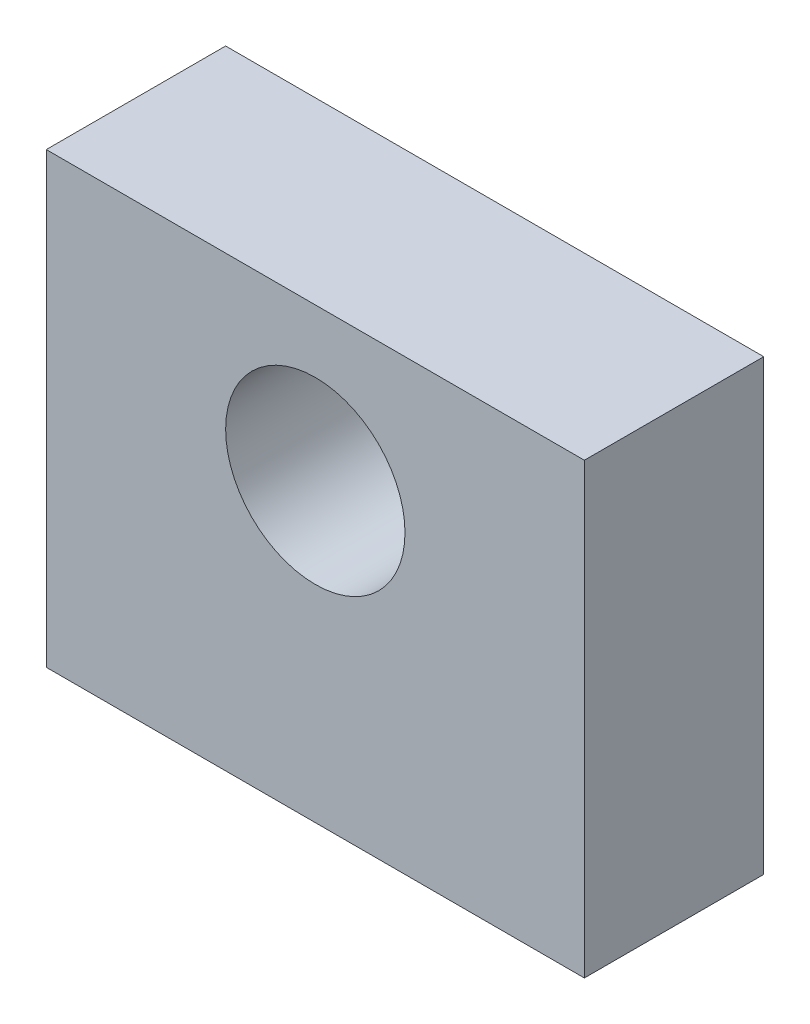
ISO-10303-21;
HEADER;
FILE_DESCRIPTION(('STEP AP214'),'2;1');
FILE_NAME('part.step','',(''),(''),'','','');
FILE_SCHEMA(('AUTOMOTIVE_DESIGN { 1 0 10303 214 1 1 1 1 }'));
ENDSEC;
DATA;
#1=APPLICATION_CONTEXT('core data for automotive mechanical design processes');
#2=APPLICATION_PROTOCOL_DEFINITION('international standard','automotive_design',2000,#1);
#3=PRODUCT_CONTEXT('',#1,'mechanical');
#4=PRODUCT('Part','Part','',(#3));
#5=PRODUCT_RELATED_PRODUCT_CATEGORY('part','',(#4));
#6=PRODUCT_DEFINITION_FORMATION('','',#4);
#7=PRODUCT_DEFINITION_CONTEXT('part definition',#1,'design');
#8=PRODUCT_DEFINITION('design','',#6,#7);
#9=PRODUCT_DEFINITION_SHAPE('','',#8);
#10=(LENGTH_UNIT() NAMED_UNIT(*) SI_UNIT(.MILLI.,.METRE.));
#11=(NAMED_UNIT(*) PLANE_ANGLE_UNIT() SI_UNIT($,.RADIAN.));
#12=(NAMED_UNIT(*) SI_UNIT($,.STERADIAN.) SOLID_ANGLE_UNIT());
#13=UNCERTAINTY_MEASURE_WITH_UNIT(LENGTH_MEASURE(1.E-05),#10,'distance_accuracy_value','');
#14=(GEOMETRIC_REPRESENTATION_CONTEXT(3) GLOBAL_UNCERTAINTY_ASSIGNED_CONTEXT((#13)) GLOBAL_UNIT_ASSIGNED_CONTEXT((#10,
#11,#12)) REPRESENTATION_CONTEXT('',''));
#15=CARTESIAN_POINT('',(0.,0.,0.));
#16=DIRECTION('',(0.,0.,1.));
#17=DIRECTION('',(1.,0.,0.));
#18=AXIS2_PLACEMENT_3D('',#15,#16,#17);
#19=CARTESIAN_POINT('',(-30.,50.0000000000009,0.));
#20=DIRECTION('',(1.,0.,0.));
#21=DIRECTION('',(0.,0.,-0.999999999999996));
#22=AXIS2_PLACEMENT_3D('',#19,#20,#21);
#23=PLANE('',#22);
#24=DIRECTION('',(0.,0.,0.999999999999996));
#25=VECTOR('',#24,1.);
#26=CARTESIAN_POINT('',(-30.,0.,0.));
#27=LINE('',#26,#25);
#28=CARTESIAN_POINT('',(-30.,0.,-19.9999999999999));
#29=VERTEX_POINT('',#28);
#30=CARTESIAN_POINT('',(-30.,0.,0.));
#31=VERTEX_POINT('',#30);
#32=EDGE_CURVE('E119',#29,#31,#27,.T.);
#33=ORIENTED_EDGE('',*,*,#32,.T.);
#34=DIRECTION('',(0.,-1.00000000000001,0.));
#35=VECTOR('',#34,1.);
#36=CARTESIAN_POINT('',(-30.,50.0000000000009,0.));
#37=LINE('',#36,#35);
#38=CARTESIAN_POINT('',(-30.,50.0000000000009,0.));
#39=VERTEX_POINT('',#38);
#40=EDGE_CURVE('E11',#39,#31,#37,.T.);
#41=ORIENTED_EDGE('',*,*,#40,.F.);
#42=DIRECTION('',(0.,0.,0.999999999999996));
#43=VECTOR('',#42,1.);
#44=CARTESIAN_POINT('',(-30.,50.0000000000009,0.));
#45=LINE('',#44,#43);
#46=CARTESIAN_POINT('',(-30.0000000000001,50.0000000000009,-19.9999999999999));
#47=VERTEX_POINT('',#46);
#48=EDGE_CURVE('E132',#47,#39,#45,.T.);
#49=ORIENTED_EDGE('',*,*,#48,.F.);
#50=DIRECTION('',(0.,-1.00000000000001,0.));
#51=VECTOR('',#50,1.);
#52=CARTESIAN_POINT('',(-30.0000000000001,50.0000000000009,-19.9999999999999));
#53=LINE('',#52,#51);
#54=EDGE_CURVE('E141',#47,#29,#53,.T.);
#55=ORIENTED_EDGE('',*,*,#54,.T.);
#56=EDGE_LOOP('',(#33,#41,#49,#55));
#57=FACE_BOUND('',#56,.T.);
#58=ADVANCED_FACE('F42',(#57),#23,.F.);
#59=CARTESIAN_POINT('',(-30.,50.0000000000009,0.));
#60=DIRECTION('',(0.,0.,-0.999999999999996));
#61=DIRECTION('',(-1.,0.,0.));
#62=AXIS2_PLACEMENT_3D('',#59,#60,#61);
#63=PLANE('',#62);
#64=CARTESIAN_POINT('',(-1.17961196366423E-13,33.0000000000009,0.));
#65=DIRECTION('',(0.,0.,-0.999999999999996));
#66=DIRECTION('',(-1.,0.,0.));
#67=AXIS2_PLACEMENT_3D('',#64,#65,#66);
#68=CIRCLE('',#67,10.);
#69=CARTESIAN_POINT('',(-10.0000000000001,33.0000000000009,0.));
#70=VERTEX_POINT('',#69);
#71=EDGE_CURVE('E99',#70,#70,#68,.F.);
#72=ORIENTED_EDGE('',*,*,#71,.F.);
#73=EDGE_LOOP('',(#72));
#74=FACE_BOUND('',#73,.T.);
#75=DIRECTION('',(1.,0.,0.));
#76=VECTOR('',#75,1.);
#77=CARTESIAN_POINT('',(-30.,0.,0.));
#78=LINE('',#77,#76);
#79=CARTESIAN_POINT('',(30.,0.,3.77475828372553E-12));
#80=VERTEX_POINT('',#79);
#81=EDGE_CURVE('E123',#31,#80,#78,.T.);
#82=ORIENTED_EDGE('',*,*,#81,.T.);
#83=DIRECTION('',(0.,-1.00000000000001,0.));
#84=VECTOR('',#83,1.);
#85=CARTESIAN_POINT('',(30.0000000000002,50.0000000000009,3.77475828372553E-12));
#86=LINE('',#85,#84);
#87=CARTESIAN_POINT('',(30.0000000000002,50.0000000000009,3.77475828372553E-12));
#88=VERTEX_POINT('',#87);
#89=EDGE_CURVE('E50',#88,#80,#86,.T.);
#90=ORIENTED_EDGE('',*,*,#89,.F.);
#91=DIRECTION('',(1.,0.,0.));
#92=VECTOR('',#91,1.);
#93=CARTESIAN_POINT('',(-30.,50.0000000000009,0.));
#94=LINE('',#93,#92);
#95=EDGE_CURVE('E135',#39,#88,#94,.T.);
#96=ORIENTED_EDGE('',*,*,#95,.F.);
#97=ORIENTED_EDGE('',*,*,#40,.T.);
#98=EDGE_LOOP('',(#82,#90,#96,#97));
#99=FACE_BOUND('',#98,.T.);
#100=ADVANCED_FACE('F165',(#74,#99),#63,.F.);
#101=CARTESIAN_POINT('',(30.0000000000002,50.0000000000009,3.77475828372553E-12));
#102=DIRECTION('',(-1.,0.,0.));
#103=DIRECTION('',(0.,0.,0.999999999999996));
#104=AXIS2_PLACEMENT_3D('',#101,#102,#103);
#105=PLANE('',#104);
#106=DIRECTION('',(0.,0.,-0.999999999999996));
#107=VECTOR('',#106,1.);
#108=CARTESIAN_POINT('',(30.,0.,3.77475828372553E-12));
#109=LINE('',#108,#107);
#110=CARTESIAN_POINT('',(30.,0.,-19.9999999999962));
#111=VERTEX_POINT('',#110);
#112=EDGE_CURVE('E126',#80,#111,#109,.T.);
#113=ORIENTED_EDGE('',*,*,#112,.T.);
#114=DIRECTION('',(0.,-1.00000000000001,0.));
#115=VECTOR('',#114,1.);
#116=CARTESIAN_POINT('',(30.,50.0000000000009,-19.9999999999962));
#117=LINE('',#116,#115);
#118=CARTESIAN_POINT('',(30.,50.0000000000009,-19.9999999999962));
#119=VERTEX_POINT('',#118);
#120=EDGE_CURVE('E145',#119,#111,#117,.T.);
#121=ORIENTED_EDGE('',*,*,#120,.F.);
#122=DIRECTION('',(0.,0.,-0.999999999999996));
#123=VECTOR('',#122,1.);
#124=CARTESIAN_POINT('',(30.0000000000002,50.0000000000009,3.77475828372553E-12));
#125=LINE('',#124,#123);
#126=EDGE_CURVE('E62',#88,#119,#125,.T.);
#127=ORIENTED_EDGE('',*,*,#126,.F.);
#128=ORIENTED_EDGE('',*,*,#89,.T.);
#129=EDGE_LOOP('',(#113,#121,#127,#128));
#130=FACE_BOUND('',#129,.T.);
#131=ADVANCED_FACE('F153',(#130),#105,.F.);
#132=CARTESIAN_POINT('',(-30.0000000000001,50.0000000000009,-19.9999999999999));
#133=DIRECTION('',(0.,0.,0.999999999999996));
#134=DIRECTION('',(1.,0.,0.));
#135=AXIS2_PLACEMENT_3D('',#132,#133,#134);
#136=PLANE('',#135);
#137=CARTESIAN_POINT('',(-1.17961196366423E-13,33.0000000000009,-20.));
#138=DIRECTION('',(0.,0.,-0.999999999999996));
#139=DIRECTION('',(-1.,0.,0.));
#140=AXIS2_PLACEMENT_3D('',#137,#138,#139);
#141=CIRCLE('',#140,10.);
#142=CARTESIAN_POINT('',(-10.0000000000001,33.0000000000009,-20.));
#143=VERTEX_POINT('',#142);
#144=EDGE_CURVE('E108',#143,#143,#141,.T.);
#145=ORIENTED_EDGE('',*,*,#144,.F.);
#146=EDGE_LOOP('',(#145));
#147=FACE_BOUND('',#146,.T.);
#148=DIRECTION('',(-1.,0.,0.));
#149=VECTOR('',#148,1.);
#150=CARTESIAN_POINT('',(-30.,0.,-19.9999999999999));
#151=LINE('',#150,#149);
#152=EDGE_CURVE('E129',#111,#29,#151,.T.);
#153=ORIENTED_EDGE('',*,*,#152,.T.);
#154=ORIENTED_EDGE('',*,*,#54,.F.);
#155=DIRECTION('',(-1.,0.,0.));
#156=VECTOR('',#155,1.);
#157=CARTESIAN_POINT('',(-30.0000000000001,50.0000000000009,-19.9999999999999));
#158=LINE('',#157,#156);
#159=EDGE_CURVE('E57',#119,#47,#158,.T.);
#160=ORIENTED_EDGE('',*,*,#159,.F.);
#161=ORIENTED_EDGE('',*,*,#120,.T.);
#162=EDGE_LOOP('',(#153,#154,#160,#161));
#163=FACE_BOUND('',#162,.T.);
#164=ADVANCED_FACE('F160',(#147,#163),#136,.F.);
#165=CARTESIAN_POINT('',(-30.0000000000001,50.0000000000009,-19.9999999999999));
#166=DIRECTION('',(0.,-1.00000000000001,0.));
#167=DIRECTION('',(0.,0.,-0.999999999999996));
#168=AXIS2_PLACEMENT_3D('',#165,#166,#167);
#169=PLANE('',#168);
#170=ORIENTED_EDGE('',*,*,#48,.T.);
#171=ORIENTED_EDGE('',*,*,#95,.T.);
#172=ORIENTED_EDGE('',*,*,#126,.T.);
#173=ORIENTED_EDGE('',*,*,#159,.T.);
#174=EDGE_LOOP('',(#170,#171,#172,#173));
#175=FACE_BOUND('',#174,.T.);
#176=ADVANCED_FACE('F164',(#175),#169,.F.);
#177=CARTESIAN_POINT('',(-30.,0.,-19.9999999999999));
#178=DIRECTION('',(0.,-1.00000000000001,0.));
#179=DIRECTION('',(0.,0.,-0.999999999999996));
#180=AXIS2_PLACEMENT_3D('',#177,#178,#179);
#181=PLANE('',#180);
#182=CARTESIAN_POINT('',(-18.,0.,-9.99999999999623));
#183=DIRECTION('',(0.,-1.00000000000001,0.));
#184=DIRECTION('',(0.,0.,-0.999999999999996));
#185=AXIS2_PLACEMENT_3D('',#182,#183,#184);
#186=CIRCLE('',#185,3.39999999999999);
#187=CARTESIAN_POINT('',(-18.,0.,-13.3999999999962));
#188=VERTEX_POINT('',#187);
#189=EDGE_CURVE('E98',#188,#188,#186,.T.);
#190=ORIENTED_EDGE('',*,*,#189,.F.);
#191=EDGE_LOOP('',(#190));
#192=FACE_BOUND('',#191,.T.);
#193=CARTESIAN_POINT('',(18.,0.,-10.));
#194=DIRECTION('',(0.,-1.00000000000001,0.));
#195=DIRECTION('',(0.,0.,-0.999999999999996));
#196=AXIS2_PLACEMENT_3D('',#193,#194,#195);
#197=CIRCLE('',#196,3.39999999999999);
#198=CARTESIAN_POINT('',(18.,0.,-13.4));
#199=VERTEX_POINT('',#198);
#200=EDGE_CURVE('E115',#199,#199,#197,.T.);
#201=ORIENTED_EDGE('',*,*,#200,.F.);
#202=EDGE_LOOP('',(#201));
#203=FACE_BOUND('',#202,.T.);
#204=ORIENTED_EDGE('',*,*,#32,.F.);
#205=ORIENTED_EDGE('',*,*,#152,.F.);
#206=ORIENTED_EDGE('',*,*,#112,.F.);
#207=ORIENTED_EDGE('',*,*,#81,.F.);
#208=EDGE_LOOP('',(#204,#205,#206,#207));
#209=FACE_BOUND('',#208,.T.);
#210=ADVANCED_FACE('F158',(#192,#203,#209),#181,.T.);
#211=CARTESIAN_POINT('',(18.,0.,-10.));
#212=DIRECTION('',(0.,-1.00000000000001,0.));
#213=DIRECTION('',(0.,0.,-0.999999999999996));
#214=AXIS2_PLACEMENT_3D('',#211,#212,#213);
#215=CYLINDRICAL_SURFACE('',#214,3.39999999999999);
#216=CARTESIAN_POINT('',(18.,22.25,-10.));
#217=DIRECTION('',(0.,-1.00000000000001,0.));
#218=DIRECTION('',(0.,0.,-0.999999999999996));
#219=AXIS2_PLACEMENT_3D('',#216,#217,#218);
#220=CIRCLE('',#219,3.39999999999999);
#221=CARTESIAN_POINT('',(18.,22.25,-13.4));
#222=VERTEX_POINT('',#221);
#223=EDGE_CURVE('E104',#222,#222,#220,.T.);
#224=ORIENTED_EDGE('',*,*,#223,.F.);
#225=EDGE_LOOP('',(#224));
#226=FACE_BOUND('',#225,.T.);
#227=ORIENTED_EDGE('',*,*,#200,.T.);
#228=EDGE_LOOP('',(#227));
#229=FACE_BOUND('',#228,.T.);
#230=ADVANCED_FACE('F182',(#226,#229),#215,.F.);
#231=CARTESIAN_POINT('',(18.,22.25,-10.));
#232=DIRECTION('',(0.,-1.00000000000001,0.));
#233=DIRECTION('',(0.,0.,-0.999999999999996));
#234=AXIS2_PLACEMENT_3D('',#231,#232,#233);
#235=CONICAL_SURFACE('',#234,3.39999999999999,1.02974425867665);
#236=CARTESIAN_POINT('',(18.,24.2929261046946,-10.));
#237=VERTEX_POINT('',#236);
#238=VERTEX_LOOP('',#237);
#239=FACE_BOUND('',#238,.T.);
#240=ORIENTED_EDGE('',*,*,#223,.T.);
#241=EDGE_LOOP('',(#240));
#242=FACE_BOUND('',#241,.T.);
#243=ADVANCED_FACE('F186',(#239,#242),#235,.F.);
#244=CARTESIAN_POINT('',(-18.,0.,-9.99999999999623));
#245=DIRECTION('',(0.,-1.00000000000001,0.));
#246=DIRECTION('',(0.,0.,-0.999999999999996));
#247=AXIS2_PLACEMENT_3D('',#244,#245,#246);
#248=CYLINDRICAL_SURFACE('',#247,3.39999999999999);
#249=CARTESIAN_POINT('',(-18.,22.25,-9.99999999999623));
#250=DIRECTION('',(0.,-1.00000000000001,0.));
#251=DIRECTION('',(0.,0.,-0.999999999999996));
#252=AXIS2_PLACEMENT_3D('',#249,#250,#251);
#253=CIRCLE('',#252,3.39999999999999);
#254=CARTESIAN_POINT('',(-18.,22.25,-13.3999999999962));
#255=VERTEX_POINT('',#254);
#256=EDGE_CURVE('E95',#255,#255,#253,.T.);
#257=ORIENTED_EDGE('',*,*,#256,.F.);
#258=EDGE_LOOP('',(#257));
#259=FACE_BOUND('',#258,.T.);
#260=ORIENTED_EDGE('',*,*,#189,.T.);
#261=EDGE_LOOP('',(#260));
#262=FACE_BOUND('',#261,.T.);
#263=ADVANCED_FACE('F91',(#259,#262),#248,.F.);
#264=CARTESIAN_POINT('',(-18.,22.25,-9.99999999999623));
#265=DIRECTION('',(0.,-1.00000000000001,0.));
#266=DIRECTION('',(0.,0.,-0.999999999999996));
#267=AXIS2_PLACEMENT_3D('',#264,#265,#266);
#268=CONICAL_SURFACE('',#267,3.39999999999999,1.02974425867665);
#269=CARTESIAN_POINT('',(-18.,24.2929261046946,-9.99999999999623));
#270=VERTEX_POINT('',#269);
#271=VERTEX_LOOP('',#270);
#272=FACE_BOUND('',#271,.T.);
#273=ORIENTED_EDGE('',*,*,#256,.T.);
#274=EDGE_LOOP('',(#273));
#275=FACE_BOUND('',#274,.T.);
#276=ADVANCED_FACE('F87',(#272,#275),#268,.F.);
#277=CARTESIAN_POINT('',(-1.17961196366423E-13,33.0000000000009,0.00100000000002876));
#278=DIRECTION('',(0.,0.,-0.999999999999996));
#279=DIRECTION('',(-1.,0.,0.));
#280=AXIS2_PLACEMENT_3D('',#277,#278,#279);
#281=CYLINDRICAL_SURFACE('',#280,10.);
#282=CARTESIAN_POINT('',(-10.0000000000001,33.0000000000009,-20.));
#283=CARTESIAN_POINT('',(-10.0000000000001,33.0000000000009,-19.7916666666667));
#284=CARTESIAN_POINT('',(-10.0000000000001,33.0000000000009,-19.5833333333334));
#285=CARTESIAN_POINT('',(-10.0000000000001,33.0000000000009,-19.1666666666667));
#286=CARTESIAN_POINT('',(-10.0000000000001,33.0000000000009,-18.9583333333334));
#287=CARTESIAN_POINT('',(-10.0000000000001,33.0000000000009,-18.5416666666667));
#288=CARTESIAN_POINT('',(-10.0000000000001,33.0000000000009,-18.3333333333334));
#289=CARTESIAN_POINT('',(-10.0000000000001,33.0000000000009,-17.9166666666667));
#290=CARTESIAN_POINT('',(-10.0000000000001,33.0000000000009,-17.7083333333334));
#291=CARTESIAN_POINT('',(-10.0000000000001,33.0000000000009,-17.2916666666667));
#292=CARTESIAN_POINT('',(-10.0000000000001,33.0000000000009,-17.0833333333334));
#293=CARTESIAN_POINT('',(-10.0000000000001,33.0000000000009,-16.6666666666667));
#294=CARTESIAN_POINT('',(-10.0000000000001,33.0000000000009,-16.4583333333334));
#295=CARTESIAN_POINT('',(-10.0000000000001,33.0000000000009,-16.0416666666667));
#296=CARTESIAN_POINT('',(-10.0000000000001,33.0000000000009,-15.8333333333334));
#297=CARTESIAN_POINT('',(-10.0000000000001,33.0000000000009,-15.4166666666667));
#298=CARTESIAN_POINT('',(-10.0000000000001,33.0000000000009,-15.2083333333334));
#299=CARTESIAN_POINT('',(-10.0000000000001,33.0000000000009,-14.7916666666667));
#300=CARTESIAN_POINT('',(-10.0000000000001,33.0000000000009,-14.5833333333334));
#301=CARTESIAN_POINT('',(-10.0000000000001,33.0000000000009,-14.1666666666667));
#302=CARTESIAN_POINT('',(-10.0000000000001,33.0000000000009,-13.9583333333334));
#303=CARTESIAN_POINT('',(-10.0000000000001,33.0000000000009,-13.5416666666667));
#304=CARTESIAN_POINT('',(-10.0000000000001,33.0000000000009,-13.3333333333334));
#305=CARTESIAN_POINT('',(-10.0000000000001,33.0000000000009,-12.9166666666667));
#306=CARTESIAN_POINT('',(-10.0000000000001,33.0000000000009,-12.7083333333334));
#307=CARTESIAN_POINT('',(-10.0000000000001,33.0000000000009,-12.2916666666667));
#308=CARTESIAN_POINT('',(-10.0000000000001,33.0000000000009,-12.0833333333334));
#309=CARTESIAN_POINT('',(-10.0000000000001,33.0000000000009,-11.6666666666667));
#310=CARTESIAN_POINT('',(-10.0000000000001,33.0000000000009,-11.4583333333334));
#311=CARTESIAN_POINT('',(-10.0000000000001,33.0000000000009,-11.0416666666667));
#312=CARTESIAN_POINT('',(-10.0000000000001,33.0000000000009,-10.8333333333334));
#313=CARTESIAN_POINT('',(-10.0000000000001,33.0000000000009,-10.4166666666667));
#314=CARTESIAN_POINT('',(-10.0000000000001,33.0000000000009,-10.2083333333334));
#315=CARTESIAN_POINT('',(-10.0000000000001,33.0000000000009,-9.79166666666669));
#316=CARTESIAN_POINT('',(-10.0000000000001,33.0000000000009,-9.58333333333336));
#317=CARTESIAN_POINT('',(-10.0000000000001,33.0000000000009,-9.16666666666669));
#318=CARTESIAN_POINT('',(-10.0000000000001,33.0000000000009,-8.95833333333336));
#319=CARTESIAN_POINT('',(-10.0000000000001,33.0000000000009,-8.54166666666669));
#320=CARTESIAN_POINT('',(-10.0000000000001,33.0000000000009,-8.33333333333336));
#321=CARTESIAN_POINT('',(-10.0000000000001,33.0000000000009,-7.91666666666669));
#322=CARTESIAN_POINT('',(-10.0000000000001,33.0000000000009,-7.70833333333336));
#323=CARTESIAN_POINT('',(-10.0000000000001,33.0000000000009,-7.29166666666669));
#324=CARTESIAN_POINT('',(-10.0000000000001,33.0000000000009,-7.08333333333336));
#325=CARTESIAN_POINT('',(-10.0000000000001,33.0000000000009,-6.66666666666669));
#326=CARTESIAN_POINT('',(-10.0000000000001,33.0000000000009,-6.45833333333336));
#327=CARTESIAN_POINT('',(-10.0000000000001,33.0000000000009,-6.04166666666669));
#328=CARTESIAN_POINT('',(-10.0000000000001,33.0000000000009,-5.83333333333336));
#329=CARTESIAN_POINT('',(-10.0000000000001,33.0000000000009,-5.41666666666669));
#330=CARTESIAN_POINT('',(-10.0000000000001,33.0000000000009,-5.20833333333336));
#331=CARTESIAN_POINT('',(-10.0000000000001,33.0000000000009,-4.79166666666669));
#332=CARTESIAN_POINT('',(-10.0000000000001,33.0000000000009,-4.58333333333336));
#333=CARTESIAN_POINT('',(-10.0000000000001,33.0000000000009,-4.16666666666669));
#334=CARTESIAN_POINT('',(-10.0000000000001,33.0000000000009,-3.95833333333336));
#335=CARTESIAN_POINT('',(-10.0000000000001,33.0000000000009,-3.54166666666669));
#336=CARTESIAN_POINT('',(-10.0000000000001,33.0000000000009,-3.33333333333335));
#337=CARTESIAN_POINT('',(-10.0000000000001,33.0000000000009,-2.91666666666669));
#338=CARTESIAN_POINT('',(-10.0000000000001,33.0000000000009,-2.70833333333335));
#339=CARTESIAN_POINT('',(-10.0000000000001,33.0000000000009,-2.29166666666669));
#340=CARTESIAN_POINT('',(-10.0000000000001,33.0000000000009,-2.08333333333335));
#341=CARTESIAN_POINT('',(-10.0000000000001,33.0000000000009,-1.66666666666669));
#342=CARTESIAN_POINT('',(-10.0000000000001,33.0000000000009,-1.45833333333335));
#343=CARTESIAN_POINT('',(-10.0000000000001,33.0000000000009,-1.04166666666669));
#344=CARTESIAN_POINT('',(-10.0000000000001,33.0000000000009,-0.833333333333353));
#345=CARTESIAN_POINT('',(-10.0000000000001,33.0000000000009,-0.416666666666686));
#346=CARTESIAN_POINT('',(-10.0000000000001,33.0000000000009,-0.208333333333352));
#347=CARTESIAN_POINT('',(-10.0000000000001,33.0000000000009,0.));
#348=B_SPLINE_CURVE_WITH_KNOTS('',3,(#282,#283,#284,#285,#286,#287,#288,#289,#290,#291,#292,
#293,#294,#295,#296,#297,#298,#299,#300,#301,#302,#303,#304,#305,#306,#307,#308,#309,#310,#311,
#312,#313,#314,#315,#316,#317,#318,#319,#320,#321,#322,#323,#324,#325,#326,#327,#328,#329,#330,
#331,#332,#333,#334,#335,#336,#337,#338,#339,#340,#341,#342,#343,#344,#345,#346,#347),
.UNSPECIFIED.,.F.,.F.,(4,2,2,2,2,2,2,2,2,2,2,2,2,2,2,2,2,2,2,2,2,2,2,2,2,2,2,2,2,2,2,2,4),(0.,
0.625000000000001,1.25,1.875,2.5,3.125,3.75,4.375,5.,5.625,6.25000000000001,6.87500000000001,
7.50000000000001,8.12500000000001,8.75000000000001,9.37500000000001,10.,10.625,11.25,11.875,
12.5,13.125,13.75,14.375,15.,15.625,16.25,16.875,17.5,18.125,18.75,19.375,20.),.UNSPECIFIED.);
#349=EDGE_CURVE('BSEAM90',#143,#70,#348,.T.);
#350=ORIENTED_EDGE('',*,*,#144,.T.);
#351=ORIENTED_EDGE('',*,*,#71,.T.);
#352=ORIENTED_EDGE('',*,*,#349,.T.);
#353=ORIENTED_EDGE('',*,*,#349,.F.);
#354=EDGE_LOOP('',(#350,#352,#351,#353));
#355=FACE_BOUND('',#354,.T.);
#356=ADVANCED_FACE('F90',(#355),#281,.F.);
#357=CLOSED_SHELL('',(#58,#100,#131,#164,#176,#210,#230,#243,#263,#276,#356));
#358=MANIFOLD_SOLID_BREP('B2',#357);
#359=ADVANCED_BREP_SHAPE_REPRESENTATION('',(#18,#358),#14);
#360=SHAPE_DEFINITION_REPRESENTATION(#9,#359);
ENDSEC;
END-ISO-10303-21;
